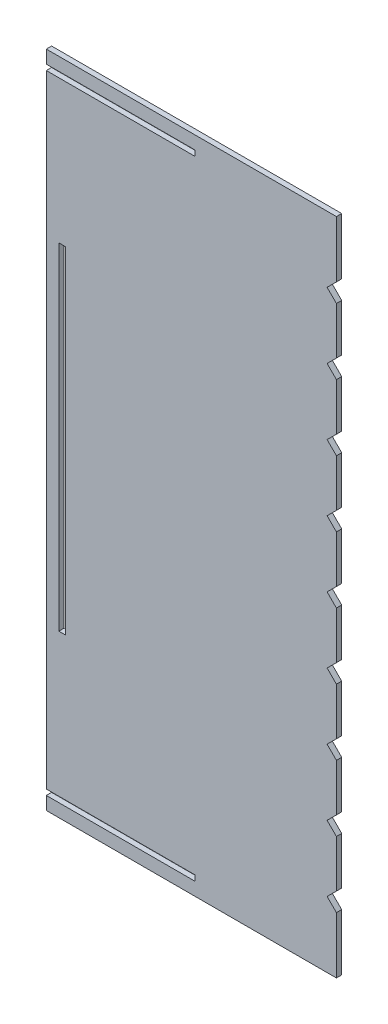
ISO-10303-21;
HEADER;
FILE_DESCRIPTION(('STEP AP214'),'2;1');
FILE_NAME('part.step','',(''),(''),'','','');
FILE_SCHEMA(('AUTOMOTIVE_DESIGN { 1 0 10303 214 1 1 1 1 }'));
ENDSEC;
DATA;
#1=APPLICATION_CONTEXT('core data for automotive mechanical design processes');
#2=APPLICATION_PROTOCOL_DEFINITION('international standard','automotive_design',2000,#1);
#3=PRODUCT_CONTEXT('',#1,'mechanical');
#4=PRODUCT('Part','Part','',(#3));
#5=PRODUCT_RELATED_PRODUCT_CATEGORY('part','',(#4));
#6=PRODUCT_DEFINITION_FORMATION('','',#4);
#7=PRODUCT_DEFINITION_CONTEXT('part definition',#1,'design');
#8=PRODUCT_DEFINITION('design','',#6,#7);
#9=PRODUCT_DEFINITION_SHAPE('','',#8);
#10=(LENGTH_UNIT() NAMED_UNIT(*) SI_UNIT(.MILLI.,.METRE.));
#11=(NAMED_UNIT(*) PLANE_ANGLE_UNIT() SI_UNIT($,.RADIAN.));
#12=(NAMED_UNIT(*) SI_UNIT($,.STERADIAN.) SOLID_ANGLE_UNIT());
#13=UNCERTAINTY_MEASURE_WITH_UNIT(LENGTH_MEASURE(1.E-05),#10,'distance_accuracy_value','');
#14=(GEOMETRIC_REPRESENTATION_CONTEXT(3) GLOBAL_UNCERTAINTY_ASSIGNED_CONTEXT((#13)) GLOBAL_UNIT_ASSIGNED_CONTEXT((#10,
#11,#12)) REPRESENTATION_CONTEXT('',''));
#15=CARTESIAN_POINT('',(0.,0.,0.));
#16=DIRECTION('',(0.,0.,1.));
#17=DIRECTION('',(1.,0.,0.));
#18=AXIS2_PLACEMENT_3D('',#15,#16,#17);
#19=CARTESIAN_POINT('',(0.,0.,4.));
#20=DIRECTION('',(0.,0.,-1.));
#21=DIRECTION('',(-1.,0.,0.));
#22=AXIS2_PLACEMENT_3D('',#19,#20,#21);
#23=PLANE('',#22);
#24=DIRECTION('',(-1.,0.,0.));
#25=VECTOR('',#24,1.);
#26=CARTESIAN_POINT('',(-1646.1818,-454.8997,4.));
#27=LINE('',#26,#25);
#28=CARTESIAN_POINT('',(-1426.1818,-454.8997,4.));
#29=VERTEX_POINT('',#28);
#30=CARTESIAN_POINT('',(-1646.1818,-454.8997,4.));
#31=VERTEX_POINT('',#30);
#32=EDGE_CURVE('E350',#29,#31,#27,.T.);
#33=ORIENTED_EDGE('',*,*,#32,.T.);
#34=DIRECTION('',(0.,-1.,0.));
#35=VECTOR('',#34,1.);
#36=CARTESIAN_POINT('',(-1646.1818,-464.7997,4.));
#37=LINE('',#36,#35);
#38=CARTESIAN_POINT('',(-1646.1818,-464.7997,4.));
#39=VERTEX_POINT('',#38);
#40=EDGE_CURVE('E353',#31,#39,#37,.T.);
#41=ORIENTED_EDGE('',*,*,#40,.T.);
#42=DIRECTION('',(1.,0.,0.));
#43=VECTOR('',#42,1.);
#44=CARTESIAN_POINT('',(-1533.3986,-464.7997,4.));
#45=LINE('',#44,#43);
#46=CARTESIAN_POINT('',(-1533.3986,-464.7997,4.));
#47=VERTEX_POINT('',#46);
#48=EDGE_CURVE('E356',#39,#47,#45,.T.);
#49=ORIENTED_EDGE('',*,*,#48,.T.);
#50=DIRECTION('',(0.,-1.,0.));
#51=VECTOR('',#50,1.);
#52=CARTESIAN_POINT('',(-1533.3986,-464.8997,4.));
#53=LINE('',#52,#51);
#54=CARTESIAN_POINT('',(-1533.3986,-468.9997,4.));
#55=VERTEX_POINT('',#54);
#56=EDGE_CURVE('E358',#47,#55,#53,.T.);
#57=ORIENTED_EDGE('',*,*,#56,.T.);
#58=DIRECTION('',(-1.,0.,0.));
#59=VECTOR('',#58,1.);
#60=CARTESIAN_POINT('',(-1646.1818,-468.9997,4.));
#61=LINE('',#60,#59);
#62=CARTESIAN_POINT('',(-1646.1818,-468.9997,4.));
#63=VERTEX_POINT('',#62);
#64=EDGE_CURVE('E360',#55,#63,#61,.T.);
#65=ORIENTED_EDGE('',*,*,#64,.T.);
#66=DIRECTION('',(0.,-1.,0.));
#67=VECTOR('',#66,1.);
#68=CARTESIAN_POINT('',(-1646.1818,-940.7996,4.));
#69=LINE('',#68,#67);
#70=CARTESIAN_POINT('',(-1646.1818,-940.7996,4.));
#71=VERTEX_POINT('',#70);
#72=EDGE_CURVE('E362',#63,#71,#69,.T.);
#73=ORIENTED_EDGE('',*,*,#72,.T.);
#74=DIRECTION('',(1.,0.,0.));
#75=VECTOR('',#74,1.);
#76=CARTESIAN_POINT('',(-1533.3986,-940.7996,4.));
#77=LINE('',#76,#75);
#78=CARTESIAN_POINT('',(-1533.3986,-940.7996,4.));
#79=VERTEX_POINT('',#78);
#80=EDGE_CURVE('E364',#71,#79,#77,.T.);
#81=ORIENTED_EDGE('',*,*,#80,.T.);
#82=DIRECTION('',(0.,-1.,0.));
#83=VECTOR('',#82,1.);
#84=CARTESIAN_POINT('',(-1533.3986,-940.8997,4.));
#85=LINE('',#84,#83);
#86=CARTESIAN_POINT('',(-1533.3986,-944.9996,4.));
#87=VERTEX_POINT('',#86);
#88=EDGE_CURVE('E366',#79,#87,#85,.T.);
#89=ORIENTED_EDGE('',*,*,#88,.T.);
#90=DIRECTION('',(-1.,0.,0.));
#91=VECTOR('',#90,1.);
#92=CARTESIAN_POINT('',(-1646.1818,-944.9996,4.));
#93=LINE('',#92,#91);
#94=CARTESIAN_POINT('',(-1646.1818,-944.9996,4.));
#95=VERTEX_POINT('',#94);
#96=EDGE_CURVE('E368',#87,#95,#93,.T.);
#97=ORIENTED_EDGE('',*,*,#96,.T.);
#98=DIRECTION('',(0.,-1.,0.));
#99=VECTOR('',#98,1.);
#100=CARTESIAN_POINT('',(-1646.1818,-954.8997,4.));
#101=LINE('',#100,#99);
#102=CARTESIAN_POINT('',(-1646.1818,-954.8997,4.));
#103=VERTEX_POINT('',#102);
#104=EDGE_CURVE('E370',#95,#103,#101,.T.);
#105=ORIENTED_EDGE('',*,*,#104,.T.);
#106=DIRECTION('',(1.,0.,0.));
#107=VECTOR('',#106,1.);
#108=CARTESIAN_POINT('',(-1426.1818,-954.8997,4.));
#109=LINE('',#108,#107);
#110=CARTESIAN_POINT('',(-1426.1818,-954.8997,4.));
#111=VERTEX_POINT('',#110);
#112=EDGE_CURVE('E372',#103,#111,#109,.T.);
#113=ORIENTED_EDGE('',*,*,#112,.T.);
#114=DIRECTION('',(0.,1.,0.));
#115=VECTOR('',#114,1.);
#116=CARTESIAN_POINT('',(-1426.1818,-911.9708,4.));
#117=LINE('',#116,#115);
#118=CARTESIAN_POINT('',(-1426.1818,-911.9708,4.));
#119=VERTEX_POINT('',#118);
#120=EDGE_CURVE('E374',#111,#119,#117,.T.);
#121=ORIENTED_EDGE('',*,*,#120,.T.);
#122=DIRECTION('',(-0.707111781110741,0.707101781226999,0.));
#123=VECTOR('',#122,1.);
#124=CARTESIAN_POINT('',(-1433.253,-904.8997,4.));
#125=LINE('',#124,#123);
#126=CARTESIAN_POINT('',(-1433.253,-904.8997,4.));
#127=VERTEX_POINT('',#126);
#128=EDGE_CURVE('E376',#119,#127,#125,.T.);
#129=ORIENTED_EDGE('',*,*,#128,.T.);
#130=DIRECTION('',(0.707116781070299,0.707096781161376,0.));
#131=VECTOR('',#130,1.);
#132=CARTESIAN_POINT('',(-1426.1818,-897.8287,4.));
#133=LINE('',#132,#131);
#134=CARTESIAN_POINT('',(-1426.1818,-897.8287,4.));
#135=VERTEX_POINT('',#134);
#136=EDGE_CURVE('E378',#127,#135,#133,.T.);
#137=ORIENTED_EDGE('',*,*,#136,.T.);
#138=DIRECTION('',(0.,1.,0.));
#139=VECTOR('',#138,1.);
#140=CARTESIAN_POINT('',(-1426.1818,-861.9708,4.));
#141=LINE('',#140,#139);
#142=CARTESIAN_POINT('',(-1426.1818,-861.9708,4.));
#143=VERTEX_POINT('',#142);
#144=EDGE_CURVE('E380',#135,#143,#141,.T.);
#145=ORIENTED_EDGE('',*,*,#144,.T.);
#146=DIRECTION('',(-0.707111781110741,0.707101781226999,0.));
#147=VECTOR('',#146,1.);
#148=CARTESIAN_POINT('',(-1433.253,-854.8997,4.));
#149=LINE('',#148,#147);
#150=CARTESIAN_POINT('',(-1433.253,-854.8997,4.));
#151=VERTEX_POINT('',#150);
#152=EDGE_CURVE('E382',#143,#151,#149,.T.);
#153=ORIENTED_EDGE('',*,*,#152,.T.);
#154=DIRECTION('',(0.707116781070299,0.707096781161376,0.));
#155=VECTOR('',#154,1.);
#156=CARTESIAN_POINT('',(-1426.1818,-847.8287,4.));
#157=LINE('',#156,#155);
#158=CARTESIAN_POINT('',(-1426.1818,-847.8287,4.));
#159=VERTEX_POINT('',#158);
#160=EDGE_CURVE('E384',#151,#159,#157,.T.);
#161=ORIENTED_EDGE('',*,*,#160,.T.);
#162=DIRECTION('',(0.,1.,0.));
#163=VECTOR('',#162,1.);
#164=CARTESIAN_POINT('',(-1426.1818,-811.9708,4.));
#165=LINE('',#164,#163);
#166=CARTESIAN_POINT('',(-1426.1818,-811.9708,4.));
#167=VERTEX_POINT('',#166);
#168=EDGE_CURVE('E386',#159,#167,#165,.T.);
#169=ORIENTED_EDGE('',*,*,#168,.T.);
#170=DIRECTION('',(-0.707111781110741,0.707101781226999,0.));
#171=VECTOR('',#170,1.);
#172=CARTESIAN_POINT('',(-1433.253,-804.8997,4.));
#173=LINE('',#172,#171);
#174=CARTESIAN_POINT('',(-1433.253,-804.8997,4.));
#175=VERTEX_POINT('',#174);
#176=EDGE_CURVE('E388',#167,#175,#173,.T.);
#177=ORIENTED_EDGE('',*,*,#176,.T.);
#178=DIRECTION('',(0.707111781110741,0.707101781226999,0.));
#179=VECTOR('',#178,1.);
#180=CARTESIAN_POINT('',(-1426.1818,-797.8286,4.));
#181=LINE('',#180,#179);
#182=CARTESIAN_POINT('',(-1426.1818,-797.8286,4.));
#183=VERTEX_POINT('',#182);
#184=EDGE_CURVE('E390',#175,#183,#181,.T.);
#185=ORIENTED_EDGE('',*,*,#184,.T.);
#186=DIRECTION('',(0.,1.,0.));
#187=VECTOR('',#186,1.);
#188=CARTESIAN_POINT('',(-1426.1818,-761.9708,4.));
#189=LINE('',#188,#187);
#190=CARTESIAN_POINT('',(-1426.1818,-761.9708,4.));
#191=VERTEX_POINT('',#190);
#192=EDGE_CURVE('E392',#183,#191,#189,.T.);
#193=ORIENTED_EDGE('',*,*,#192,.T.);
#194=DIRECTION('',(-0.707111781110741,0.707101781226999,0.));
#195=VECTOR('',#194,1.);
#196=CARTESIAN_POINT('',(-1433.253,-754.8997,4.));
#197=LINE('',#196,#195);
#198=CARTESIAN_POINT('',(-1433.253,-754.8997,4.));
#199=VERTEX_POINT('',#198);
#200=EDGE_CURVE('E394',#191,#199,#197,.T.);
#201=ORIENTED_EDGE('',*,*,#200,.T.);
#202=DIRECTION('',(0.707111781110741,0.707101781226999,0.));
#203=VECTOR('',#202,1.);
#204=CARTESIAN_POINT('',(-1426.1818,-747.8286,4.));
#205=LINE('',#204,#203);
#206=CARTESIAN_POINT('',(-1426.1818,-747.8286,4.));
#207=VERTEX_POINT('',#206);
#208=EDGE_CURVE('E396',#199,#207,#205,.T.);
#209=ORIENTED_EDGE('',*,*,#208,.T.);
#210=DIRECTION('',(0.,1.,0.));
#211=VECTOR('',#210,1.);
#212=CARTESIAN_POINT('',(-1426.1818,-711.9708,4.));
#213=LINE('',#212,#211);
#214=CARTESIAN_POINT('',(-1426.1818,-711.9708,4.));
#215=VERTEX_POINT('',#214);
#216=EDGE_CURVE('E398',#207,#215,#213,.T.);
#217=ORIENTED_EDGE('',*,*,#216,.T.);
#218=DIRECTION('',(-0.707111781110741,0.707101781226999,0.));
#219=VECTOR('',#218,1.);
#220=CARTESIAN_POINT('',(-1433.253,-704.8997,4.));
#221=LINE('',#220,#219);
#222=CARTESIAN_POINT('',(-1433.253,-704.8997,4.));
#223=VERTEX_POINT('',#222);
#224=EDGE_CURVE('E400',#215,#223,#221,.T.);
#225=ORIENTED_EDGE('',*,*,#224,.T.);
#226=DIRECTION('',(0.707111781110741,0.707101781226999,0.));
#227=VECTOR('',#226,1.);
#228=CARTESIAN_POINT('',(-1426.1818,-697.8286,4.));
#229=LINE('',#228,#227);
#230=CARTESIAN_POINT('',(-1426.1818,-697.8286,4.));
#231=VERTEX_POINT('',#230);
#232=EDGE_CURVE('E402',#223,#231,#229,.T.);
#233=ORIENTED_EDGE('',*,*,#232,.T.);
#234=DIRECTION('',(0.,1.,0.));
#235=VECTOR('',#234,1.);
#236=CARTESIAN_POINT('',(-1426.1818,-661.9708,4.));
#237=LINE('',#236,#235);
#238=CARTESIAN_POINT('',(-1426.1818,-661.9708,4.));
#239=VERTEX_POINT('',#238);
#240=EDGE_CURVE('E404',#231,#239,#237,.T.);
#241=ORIENTED_EDGE('',*,*,#240,.T.);
#242=DIRECTION('',(-0.707111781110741,0.707101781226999,0.));
#243=VECTOR('',#242,1.);
#244=CARTESIAN_POINT('',(-1433.253,-654.8997,4.));
#245=LINE('',#244,#243);
#246=CARTESIAN_POINT('',(-1433.253,-654.8997,4.));
#247=VERTEX_POINT('',#246);
#248=EDGE_CURVE('E406',#239,#247,#245,.T.);
#249=ORIENTED_EDGE('',*,*,#248,.T.);
#250=DIRECTION('',(0.707111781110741,0.707101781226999,0.));
#251=VECTOR('',#250,1.);
#252=CARTESIAN_POINT('',(-1426.1818,-647.8286,4.));
#253=LINE('',#252,#251);
#254=CARTESIAN_POINT('',(-1426.1818,-647.8286,4.));
#255=VERTEX_POINT('',#254);
#256=EDGE_CURVE('E408',#247,#255,#253,.T.);
#257=ORIENTED_EDGE('',*,*,#256,.T.);
#258=DIRECTION('',(0.,1.,0.));
#259=VECTOR('',#258,1.);
#260=CARTESIAN_POINT('',(-1426.1818,-611.9708,4.));
#261=LINE('',#260,#259);
#262=CARTESIAN_POINT('',(-1426.1818,-611.9708,4.));
#263=VERTEX_POINT('',#262);
#264=EDGE_CURVE('E410',#255,#263,#261,.T.);
#265=ORIENTED_EDGE('',*,*,#264,.T.);
#266=DIRECTION('',(-0.707111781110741,0.707101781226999,0.));
#267=VECTOR('',#266,1.);
#268=CARTESIAN_POINT('',(-1433.253,-604.8997,4.));
#269=LINE('',#268,#267);
#270=CARTESIAN_POINT('',(-1433.253,-604.8997,4.));
#271=VERTEX_POINT('',#270);
#272=EDGE_CURVE('E412',#263,#271,#269,.T.);
#273=ORIENTED_EDGE('',*,*,#272,.T.);
#274=DIRECTION('',(0.707111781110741,0.707101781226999,0.));
#275=VECTOR('',#274,1.);
#276=CARTESIAN_POINT('',(-1426.1818,-597.8286,4.));
#277=LINE('',#276,#275);
#278=CARTESIAN_POINT('',(-1426.1818,-597.8286,4.));
#279=VERTEX_POINT('',#278);
#280=EDGE_CURVE('E414',#271,#279,#277,.T.);
#281=ORIENTED_EDGE('',*,*,#280,.T.);
#282=DIRECTION('',(0.,1.,0.));
#283=VECTOR('',#282,1.);
#284=CARTESIAN_POINT('',(-1426.1818,-561.9708,4.));
#285=LINE('',#284,#283);
#286=CARTESIAN_POINT('',(-1426.1818,-561.9708,4.));
#287=VERTEX_POINT('',#286);
#288=EDGE_CURVE('E416',#279,#287,#285,.T.);
#289=ORIENTED_EDGE('',*,*,#288,.T.);
#290=DIRECTION('',(-0.707111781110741,0.707101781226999,0.));
#291=VECTOR('',#290,1.);
#292=CARTESIAN_POINT('',(-1433.253,-554.8997,4.));
#293=LINE('',#292,#291);
#294=CARTESIAN_POINT('',(-1433.253,-554.8997,4.));
#295=VERTEX_POINT('',#294);
#296=EDGE_CURVE('E418',#287,#295,#293,.T.);
#297=ORIENTED_EDGE('',*,*,#296,.T.);
#298=DIRECTION('',(0.707116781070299,0.707096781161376,0.));
#299=VECTOR('',#298,1.);
#300=CARTESIAN_POINT('',(-1426.1818,-547.8287,4.));
#301=LINE('',#300,#299);
#302=CARTESIAN_POINT('',(-1426.1818,-547.8287,4.));
#303=VERTEX_POINT('',#302);
#304=EDGE_CURVE('E420',#295,#303,#301,.T.);
#305=ORIENTED_EDGE('',*,*,#304,.T.);
#306=DIRECTION('',(0.,1.,0.));
#307=VECTOR('',#306,1.);
#308=CARTESIAN_POINT('',(-1426.1818,-511.9708,4.));
#309=LINE('',#308,#307);
#310=CARTESIAN_POINT('',(-1426.1818,-511.9708,4.));
#311=VERTEX_POINT('',#310);
#312=EDGE_CURVE('E422',#303,#311,#309,.T.);
#313=ORIENTED_EDGE('',*,*,#312,.T.);
#314=DIRECTION('',(-0.707111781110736,0.707101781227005,0.));
#315=VECTOR('',#314,1.);
#316=CARTESIAN_POINT('',(-1433.253,-504.8997,4.));
#317=LINE('',#316,#315);
#318=CARTESIAN_POINT('',(-1433.253,-504.8997,4.));
#319=VERTEX_POINT('',#318);
#320=EDGE_CURVE('E424',#311,#319,#317,.T.);
#321=ORIENTED_EDGE('',*,*,#320,.T.);
#322=DIRECTION('',(0.707116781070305,0.70709678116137,0.));
#323=VECTOR('',#322,1.);
#324=CARTESIAN_POINT('',(-1426.1818,-497.8287,4.));
#325=LINE('',#324,#323);
#326=CARTESIAN_POINT('',(-1426.1818,-497.8287,4.));
#327=VERTEX_POINT('',#326);
#328=EDGE_CURVE('E426',#319,#327,#325,.T.);
#329=ORIENTED_EDGE('',*,*,#328,.T.);
#330=DIRECTION('',(0.,1.,0.));
#331=VECTOR('',#330,1.);
#332=CARTESIAN_POINT('',(-1426.1818,-454.8997,4.));
#333=LINE('',#332,#331);
#334=EDGE_CURVE('E428',#327,#29,#333,.T.);
#335=ORIENTED_EDGE('',*,*,#334,.T.);
#336=EDGE_LOOP('',(#33,#41,#49,#57,#65,#73,#81,#89,#97,#105,#113,#121,#129,#137,#145,#153,#161,
#169,#177,#185,#193,#201,#209,#217,#225,#233,#241,#249,#257,#265,#273,#281,#289,#297,#305,#313,
#321,#329,#335));
#337=FACE_BOUND('',#336,.T.);
#338=DIRECTION('',(1.,0.,0.));
#339=VECTOR('',#338,1.);
#340=CARTESIAN_POINT('',(-1636.6818,-832.3997,4.));
#341=LINE('',#340,#339);
#342=CARTESIAN_POINT('',(-1636.6818,-832.3997,4.));
#343=VERTEX_POINT('',#342);
#344=CARTESIAN_POINT('',(-1631.6818,-832.3997,4.));
#345=VERTEX_POINT('',#344);
#346=EDGE_CURVE('E314',#343,#345,#341,.T.);
#347=ORIENTED_EDGE('',*,*,#346,.F.);
#348=DIRECTION('',(0.,-1.,0.));
#349=VECTOR('',#348,1.);
#350=CARTESIAN_POINT('',(-1636.6818,-577.3997,4.));
#351=LINE('',#350,#349);
#352=CARTESIAN_POINT('',(-1636.6818,-577.3997,4.));
#353=VERTEX_POINT('',#352);
#354=EDGE_CURVE('E336',#353,#343,#351,.T.);
#355=ORIENTED_EDGE('',*,*,#354,.F.);
#356=DIRECTION('',(-1.,0.,0.));
#357=VECTOR('',#356,1.);
#358=CARTESIAN_POINT('',(-1631.6818,-577.3997,4.));
#359=LINE('',#358,#357);
#360=CARTESIAN_POINT('',(-1631.6818,-577.3997,4.));
#361=VERTEX_POINT('',#360);
#362=EDGE_CURVE('E334',#361,#353,#359,.T.);
#363=ORIENTED_EDGE('',*,*,#362,.F.);
#364=DIRECTION('',(0.,1.,0.));
#365=VECTOR('',#364,1.);
#366=CARTESIAN_POINT('',(-1631.6818,-832.3997,4.));
#367=LINE('',#366,#365);
#368=EDGE_CURVE('E322',#345,#361,#367,.T.);
#369=ORIENTED_EDGE('',*,*,#368,.F.);
#370=EDGE_LOOP('',(#347,#355,#363,#369));
#371=FACE_BOUND('',#370,.T.);
#372=ADVANCED_FACE('F39',(#337,#371),#23,.F.);
#373=CARTESIAN_POINT('',(0.,0.,0.));
#374=DIRECTION('',(0.,0.,-1.));
#375=DIRECTION('',(-1.,0.,0.));
#376=AXIS2_PLACEMENT_3D('',#373,#374,#375);
#377=PLANE('',#376);
#378=DIRECTION('',(-1.,0.,0.));
#379=VECTOR('',#378,1.);
#380=CARTESIAN_POINT('',(-1646.1818,-454.8997,0.));
#381=LINE('',#380,#379);
#382=CARTESIAN_POINT('',(-1426.1818,-454.8997,0.));
#383=VERTEX_POINT('',#382);
#384=CARTESIAN_POINT('',(-1646.1818,-454.8997,0.));
#385=VERTEX_POINT('',#384);
#386=EDGE_CURVE('E330',#383,#385,#381,.T.);
#387=ORIENTED_EDGE('',*,*,#386,.F.);
#388=DIRECTION('',(0.,1.,0.));
#389=VECTOR('',#388,1.);
#390=CARTESIAN_POINT('',(-1426.1818,-454.8997,0.));
#391=LINE('',#390,#389);
#392=CARTESIAN_POINT('',(-1426.1818,-497.8287,0.));
#393=VERTEX_POINT('',#392);
#394=EDGE_CURVE('E354',#393,#383,#391,.T.);
#395=ORIENTED_EDGE('',*,*,#394,.F.);
#396=DIRECTION('',(0.707116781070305,0.70709678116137,0.));
#397=VECTOR('',#396,1.);
#398=CARTESIAN_POINT('',(-1426.1818,-497.8287,0.));
#399=LINE('',#398,#397);
#400=CARTESIAN_POINT('',(-1433.253,-504.8997,0.));
#401=VERTEX_POINT('',#400);
#402=EDGE_CURVE('E507',#401,#393,#399,.T.);
#403=ORIENTED_EDGE('',*,*,#402,.F.);
#404=DIRECTION('',(-0.707111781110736,0.707101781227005,0.));
#405=VECTOR('',#404,1.);
#406=CARTESIAN_POINT('',(-1433.253,-504.8997,0.));
#407=LINE('',#406,#405);
#408=CARTESIAN_POINT('',(-1426.1818,-511.9708,0.));
#409=VERTEX_POINT('',#408);
#410=EDGE_CURVE('E505',#409,#401,#407,.T.);
#411=ORIENTED_EDGE('',*,*,#410,.F.);
#412=DIRECTION('',(0.,1.,0.));
#413=VECTOR('',#412,1.);
#414=CARTESIAN_POINT('',(-1426.1818,-511.9708,0.));
#415=LINE('',#414,#413);
#416=CARTESIAN_POINT('',(-1426.1818,-547.8287,0.));
#417=VERTEX_POINT('',#416);
#418=EDGE_CURVE('E503',#417,#409,#415,.T.);
#419=ORIENTED_EDGE('',*,*,#418,.F.);
#420=DIRECTION('',(0.707116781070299,0.707096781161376,0.));
#421=VECTOR('',#420,1.);
#422=CARTESIAN_POINT('',(-1426.1818,-547.8287,0.));
#423=LINE('',#422,#421);
#424=CARTESIAN_POINT('',(-1433.253,-554.8997,0.));
#425=VERTEX_POINT('',#424);
#426=EDGE_CURVE('E501',#425,#417,#423,.T.);
#427=ORIENTED_EDGE('',*,*,#426,.F.);
#428=DIRECTION('',(-0.707111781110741,0.707101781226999,0.));
#429=VECTOR('',#428,1.);
#430=CARTESIAN_POINT('',(-1433.253,-554.8997,0.));
#431=LINE('',#430,#429);
#432=CARTESIAN_POINT('',(-1426.1818,-561.9708,0.));
#433=VERTEX_POINT('',#432);
#434=EDGE_CURVE('E499',#433,#425,#431,.T.);
#435=ORIENTED_EDGE('',*,*,#434,.F.);
#436=DIRECTION('',(0.,1.,0.));
#437=VECTOR('',#436,1.);
#438=CARTESIAN_POINT('',(-1426.1818,-561.9708,0.));
#439=LINE('',#438,#437);
#440=CARTESIAN_POINT('',(-1426.1818,-597.8286,0.));
#441=VERTEX_POINT('',#440);
#442=EDGE_CURVE('E497',#441,#433,#439,.T.);
#443=ORIENTED_EDGE('',*,*,#442,.F.);
#444=DIRECTION('',(0.707111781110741,0.707101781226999,0.));
#445=VECTOR('',#444,1.);
#446=CARTESIAN_POINT('',(-1426.1818,-597.8286,0.));
#447=LINE('',#446,#445);
#448=CARTESIAN_POINT('',(-1433.253,-604.8997,0.));
#449=VERTEX_POINT('',#448);
#450=EDGE_CURVE('E495',#449,#441,#447,.T.);
#451=ORIENTED_EDGE('',*,*,#450,.F.);
#452=DIRECTION('',(-0.707111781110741,0.707101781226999,0.));
#453=VECTOR('',#452,1.);
#454=CARTESIAN_POINT('',(-1433.253,-604.8997,0.));
#455=LINE('',#454,#453);
#456=CARTESIAN_POINT('',(-1426.1818,-611.9708,0.));
#457=VERTEX_POINT('',#456);
#458=EDGE_CURVE('E493',#457,#449,#455,.T.);
#459=ORIENTED_EDGE('',*,*,#458,.F.);
#460=DIRECTION('',(0.,1.,0.));
#461=VECTOR('',#460,1.);
#462=CARTESIAN_POINT('',(-1426.1818,-611.9708,0.));
#463=LINE('',#462,#461);
#464=CARTESIAN_POINT('',(-1426.1818,-647.8286,0.));
#465=VERTEX_POINT('',#464);
#466=EDGE_CURVE('E491',#465,#457,#463,.T.);
#467=ORIENTED_EDGE('',*,*,#466,.F.);
#468=DIRECTION('',(0.707111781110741,0.707101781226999,0.));
#469=VECTOR('',#468,1.);
#470=CARTESIAN_POINT('',(-1426.1818,-647.8286,0.));
#471=LINE('',#470,#469);
#472=CARTESIAN_POINT('',(-1433.253,-654.8997,0.));
#473=VERTEX_POINT('',#472);
#474=EDGE_CURVE('E489',#473,#465,#471,.T.);
#475=ORIENTED_EDGE('',*,*,#474,.F.);
#476=DIRECTION('',(-0.707111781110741,0.707101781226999,0.));
#477=VECTOR('',#476,1.);
#478=CARTESIAN_POINT('',(-1433.253,-654.8997,0.));
#479=LINE('',#478,#477);
#480=CARTESIAN_POINT('',(-1426.1818,-661.9708,0.));
#481=VERTEX_POINT('',#480);
#482=EDGE_CURVE('E487',#481,#473,#479,.T.);
#483=ORIENTED_EDGE('',*,*,#482,.F.);
#484=DIRECTION('',(0.,1.,0.));
#485=VECTOR('',#484,1.);
#486=CARTESIAN_POINT('',(-1426.1818,-661.9708,0.));
#487=LINE('',#486,#485);
#488=CARTESIAN_POINT('',(-1426.1818,-697.8286,0.));
#489=VERTEX_POINT('',#488);
#490=EDGE_CURVE('E485',#489,#481,#487,.T.);
#491=ORIENTED_EDGE('',*,*,#490,.F.);
#492=DIRECTION('',(0.707111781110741,0.707101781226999,0.));
#493=VECTOR('',#492,1.);
#494=CARTESIAN_POINT('',(-1426.1818,-697.8286,0.));
#495=LINE('',#494,#493);
#496=CARTESIAN_POINT('',(-1433.253,-704.8997,0.));
#497=VERTEX_POINT('',#496);
#498=EDGE_CURVE('E483',#497,#489,#495,.T.);
#499=ORIENTED_EDGE('',*,*,#498,.F.);
#500=DIRECTION('',(-0.707111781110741,0.707101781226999,0.));
#501=VECTOR('',#500,1.);
#502=CARTESIAN_POINT('',(-1433.253,-704.8997,0.));
#503=LINE('',#502,#501);
#504=CARTESIAN_POINT('',(-1426.1818,-711.9708,0.));
#505=VERTEX_POINT('',#504);
#506=EDGE_CURVE('E481',#505,#497,#503,.T.);
#507=ORIENTED_EDGE('',*,*,#506,.F.);
#508=DIRECTION('',(0.,1.,0.));
#509=VECTOR('',#508,1.);
#510=CARTESIAN_POINT('',(-1426.1818,-711.9708,0.));
#511=LINE('',#510,#509);
#512=CARTESIAN_POINT('',(-1426.1818,-747.8286,0.));
#513=VERTEX_POINT('',#512);
#514=EDGE_CURVE('E479',#513,#505,#511,.T.);
#515=ORIENTED_EDGE('',*,*,#514,.F.);
#516=DIRECTION('',(0.707111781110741,0.707101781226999,0.));
#517=VECTOR('',#516,1.);
#518=CARTESIAN_POINT('',(-1426.1818,-747.8286,0.));
#519=LINE('',#518,#517);
#520=CARTESIAN_POINT('',(-1433.253,-754.8997,0.));
#521=VERTEX_POINT('',#520);
#522=EDGE_CURVE('E477',#521,#513,#519,.T.);
#523=ORIENTED_EDGE('',*,*,#522,.F.);
#524=DIRECTION('',(-0.707111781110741,0.707101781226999,0.));
#525=VECTOR('',#524,1.);
#526=CARTESIAN_POINT('',(-1433.253,-754.8997,0.));
#527=LINE('',#526,#525);
#528=CARTESIAN_POINT('',(-1426.1818,-761.9708,0.));
#529=VERTEX_POINT('',#528);
#530=EDGE_CURVE('E475',#529,#521,#527,.T.);
#531=ORIENTED_EDGE('',*,*,#530,.F.);
#532=DIRECTION('',(0.,1.,0.));
#533=VECTOR('',#532,1.);
#534=CARTESIAN_POINT('',(-1426.1818,-761.9708,0.));
#535=LINE('',#534,#533);
#536=CARTESIAN_POINT('',(-1426.1818,-797.8286,0.));
#537=VERTEX_POINT('',#536);
#538=EDGE_CURVE('E473',#537,#529,#535,.T.);
#539=ORIENTED_EDGE('',*,*,#538,.F.);
#540=DIRECTION('',(0.707111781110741,0.707101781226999,0.));
#541=VECTOR('',#540,1.);
#542=CARTESIAN_POINT('',(-1426.1818,-797.8286,0.));
#543=LINE('',#542,#541);
#544=CARTESIAN_POINT('',(-1433.253,-804.8997,0.));
#545=VERTEX_POINT('',#544);
#546=EDGE_CURVE('E471',#545,#537,#543,.T.);
#547=ORIENTED_EDGE('',*,*,#546,.F.);
#548=DIRECTION('',(-0.707111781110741,0.707101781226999,0.));
#549=VECTOR('',#548,1.);
#550=CARTESIAN_POINT('',(-1433.253,-804.8997,0.));
#551=LINE('',#550,#549);
#552=CARTESIAN_POINT('',(-1426.1818,-811.9708,0.));
#553=VERTEX_POINT('',#552);
#554=EDGE_CURVE('E469',#553,#545,#551,.T.);
#555=ORIENTED_EDGE('',*,*,#554,.F.);
#556=DIRECTION('',(0.,1.,0.));
#557=VECTOR('',#556,1.);
#558=CARTESIAN_POINT('',(-1426.1818,-811.9708,0.));
#559=LINE('',#558,#557);
#560=CARTESIAN_POINT('',(-1426.1818,-847.8287,0.));
#561=VERTEX_POINT('',#560);
#562=EDGE_CURVE('E467',#561,#553,#559,.T.);
#563=ORIENTED_EDGE('',*,*,#562,.F.);
#564=DIRECTION('',(0.707116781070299,0.707096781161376,0.));
#565=VECTOR('',#564,1.);
#566=CARTESIAN_POINT('',(-1426.1818,-847.8287,0.));
#567=LINE('',#566,#565);
#568=CARTESIAN_POINT('',(-1433.253,-854.8997,0.));
#569=VERTEX_POINT('',#568);
#570=EDGE_CURVE('E465',#569,#561,#567,.T.);
#571=ORIENTED_EDGE('',*,*,#570,.F.);
#572=DIRECTION('',(-0.707111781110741,0.707101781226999,0.));
#573=VECTOR('',#572,1.);
#574=CARTESIAN_POINT('',(-1433.253,-854.8997,0.));
#575=LINE('',#574,#573);
#576=CARTESIAN_POINT('',(-1426.1818,-861.9708,0.));
#577=VERTEX_POINT('',#576);
#578=EDGE_CURVE('E463',#577,#569,#575,.T.);
#579=ORIENTED_EDGE('',*,*,#578,.F.);
#580=DIRECTION('',(0.,1.,0.));
#581=VECTOR('',#580,1.);
#582=CARTESIAN_POINT('',(-1426.1818,-861.9708,0.));
#583=LINE('',#582,#581);
#584=CARTESIAN_POINT('',(-1426.1818,-897.8287,0.));
#585=VERTEX_POINT('',#584);
#586=EDGE_CURVE('E461',#585,#577,#583,.T.);
#587=ORIENTED_EDGE('',*,*,#586,.F.);
#588=DIRECTION('',(0.707116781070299,0.707096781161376,0.));
#589=VECTOR('',#588,1.);
#590=CARTESIAN_POINT('',(-1426.1818,-897.8287,0.));
#591=LINE('',#590,#589);
#592=CARTESIAN_POINT('',(-1433.253,-904.8997,0.));
#593=VERTEX_POINT('',#592);
#594=EDGE_CURVE('E459',#593,#585,#591,.T.);
#595=ORIENTED_EDGE('',*,*,#594,.F.);
#596=DIRECTION('',(-0.707111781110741,0.707101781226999,0.));
#597=VECTOR('',#596,1.);
#598=CARTESIAN_POINT('',(-1433.253,-904.8997,0.));
#599=LINE('',#598,#597);
#600=CARTESIAN_POINT('',(-1426.1818,-911.9708,0.));
#601=VERTEX_POINT('',#600);
#602=EDGE_CURVE('E457',#601,#593,#599,.T.);
#603=ORIENTED_EDGE('',*,*,#602,.F.);
#604=DIRECTION('',(0.,1.,0.));
#605=VECTOR('',#604,1.);
#606=CARTESIAN_POINT('',(-1426.1818,-911.9708,0.));
#607=LINE('',#606,#605);
#608=CARTESIAN_POINT('',(-1426.1818,-954.8997,0.));
#609=VERTEX_POINT('',#608);
#610=EDGE_CURVE('E455',#609,#601,#607,.T.);
#611=ORIENTED_EDGE('',*,*,#610,.F.);
#612=DIRECTION('',(1.,0.,0.));
#613=VECTOR('',#612,1.);
#614=CARTESIAN_POINT('',(-1426.1818,-954.8997,0.));
#615=LINE('',#614,#613);
#616=CARTESIAN_POINT('',(-1646.1818,-954.8997,0.));
#617=VERTEX_POINT('',#616);
#618=EDGE_CURVE('E453',#617,#609,#615,.T.);
#619=ORIENTED_EDGE('',*,*,#618,.F.);
#620=DIRECTION('',(0.,-1.,0.));
#621=VECTOR('',#620,1.);
#622=CARTESIAN_POINT('',(-1646.1818,-954.8997,0.));
#623=LINE('',#622,#621);
#624=CARTESIAN_POINT('',(-1646.1818,-944.9996,0.));
#625=VERTEX_POINT('',#624);
#626=EDGE_CURVE('E451',#625,#617,#623,.T.);
#627=ORIENTED_EDGE('',*,*,#626,.F.);
#628=DIRECTION('',(-1.,0.,0.));
#629=VECTOR('',#628,1.);
#630=CARTESIAN_POINT('',(-1646.1818,-944.9996,0.));
#631=LINE('',#630,#629);
#632=CARTESIAN_POINT('',(-1533.3986,-944.9996,0.));
#633=VERTEX_POINT('',#632);
#634=EDGE_CURVE('E449',#633,#625,#631,.T.);
#635=ORIENTED_EDGE('',*,*,#634,.F.);
#636=DIRECTION('',(0.,-1.,0.));
#637=VECTOR('',#636,1.);
#638=CARTESIAN_POINT('',(-1533.3986,-944.9996,0.));
#639=LINE('',#638,#637);
#640=CARTESIAN_POINT('',(-1533.3986,-940.7996,0.));
#641=VERTEX_POINT('',#640);
#642=EDGE_CURVE('E447',#641,#633,#639,.T.);
#643=ORIENTED_EDGE('',*,*,#642,.F.);
#644=DIRECTION('',(1.,0.,0.));
#645=VECTOR('',#644,1.);
#646=CARTESIAN_POINT('',(-1533.3986,-940.7996,0.));
#647=LINE('',#646,#645);
#648=CARTESIAN_POINT('',(-1646.1818,-940.7996,0.));
#649=VERTEX_POINT('',#648);
#650=EDGE_CURVE('E444',#649,#641,#647,.T.);
#651=ORIENTED_EDGE('',*,*,#650,.F.);
#652=DIRECTION('',(0.,-1.,0.));
#653=VECTOR('',#652,1.);
#654=CARTESIAN_POINT('',(-1646.1818,-940.7996,0.));
#655=LINE('',#654,#653);
#656=CARTESIAN_POINT('',(-1646.1818,-468.9997,0.));
#657=VERTEX_POINT('',#656);
#658=EDGE_CURVE('E442',#657,#649,#655,.T.);
#659=ORIENTED_EDGE('',*,*,#658,.F.);
#660=DIRECTION('',(-1.,0.,0.));
#661=VECTOR('',#660,1.);
#662=CARTESIAN_POINT('',(-1646.1818,-468.9997,0.));
#663=LINE('',#662,#661);
#664=CARTESIAN_POINT('',(-1533.3986,-468.9997,0.));
#665=VERTEX_POINT('',#664);
#666=EDGE_CURVE('E440',#665,#657,#663,.T.);
#667=ORIENTED_EDGE('',*,*,#666,.F.);
#668=DIRECTION('',(0.,-1.,0.));
#669=VECTOR('',#668,1.);
#670=CARTESIAN_POINT('',(-1533.3986,-468.9997,0.));
#671=LINE('',#670,#669);
#672=CARTESIAN_POINT('',(-1533.3986,-464.7997,0.));
#673=VERTEX_POINT('',#672);
#674=EDGE_CURVE('E438',#673,#665,#671,.T.);
#675=ORIENTED_EDGE('',*,*,#674,.F.);
#676=DIRECTION('',(1.,0.,0.));
#677=VECTOR('',#676,1.);
#678=CARTESIAN_POINT('',(-1533.3986,-464.7997,0.));
#679=LINE('',#678,#677);
#680=CARTESIAN_POINT('',(-1646.1818,-464.7997,0.));
#681=VERTEX_POINT('',#680);
#682=EDGE_CURVE('E435',#681,#673,#679,.T.);
#683=ORIENTED_EDGE('',*,*,#682,.F.);
#684=DIRECTION('',(0.,-1.,0.));
#685=VECTOR('',#684,1.);
#686=CARTESIAN_POINT('',(-1646.1818,-464.7997,0.));
#687=LINE('',#686,#685);
#688=EDGE_CURVE('E433',#385,#681,#687,.T.);
#689=ORIENTED_EDGE('',*,*,#688,.F.);
#690=EDGE_LOOP('',(#387,#395,#403,#411,#419,#427,#435,#443,#451,#459,#467,#475,#483,#491,#499,
#507,#515,#523,#531,#539,#547,#555,#563,#571,#579,#587,#595,#603,#611,#619,#627,#635,#643,#651,
#659,#667,#675,#683,#689));
#691=FACE_BOUND('',#690,.T.);
#692=DIRECTION('',(0.,-1.,0.));
#693=VECTOR('',#692,1.);
#694=CARTESIAN_POINT('',(-1636.6818,-577.3997,0.));
#695=LINE('',#694,#693);
#696=CARTESIAN_POINT('',(-1636.6818,-577.3997,0.));
#697=VERTEX_POINT('',#696);
#698=CARTESIAN_POINT('',(-1636.6818,-832.3997,0.));
#699=VERTEX_POINT('',#698);
#700=EDGE_CURVE('E323',#697,#699,#695,.T.);
#701=ORIENTED_EDGE('',*,*,#700,.T.);
#702=DIRECTION('',(1.,0.,0.));
#703=VECTOR('',#702,1.);
#704=CARTESIAN_POINT('',(-1636.6818,-832.3997,0.));
#705=LINE('',#704,#703);
#706=CARTESIAN_POINT('',(-1631.6818,-832.3997,0.));
#707=VERTEX_POINT('',#706);
#708=EDGE_CURVE('E62',#699,#707,#705,.T.);
#709=ORIENTED_EDGE('',*,*,#708,.T.);
#710=DIRECTION('',(0.,1.,0.));
#711=VECTOR('',#710,1.);
#712=CARTESIAN_POINT('',(-1631.6818,-832.3997,0.));
#713=LINE('',#712,#711);
#714=CARTESIAN_POINT('',(-1631.6818,-577.3997,0.));
#715=VERTEX_POINT('',#714);
#716=EDGE_CURVE('E329',#707,#715,#713,.T.);
#717=ORIENTED_EDGE('',*,*,#716,.T.);
#718=DIRECTION('',(-1.,0.,0.));
#719=VECTOR('',#718,1.);
#720=CARTESIAN_POINT('',(-1631.6818,-577.3997,0.));
#721=LINE('',#720,#719);
#722=EDGE_CURVE('E342',#715,#697,#721,.T.);
#723=ORIENTED_EDGE('',*,*,#722,.T.);
#724=EDGE_LOOP('',(#701,#709,#717,#723));
#725=FACE_BOUND('',#724,.T.);
#726=ADVANCED_FACE('F629',(#691,#725),#377,.T.);
#727=CARTESIAN_POINT('',(-1646.1818,-454.8997,4.));
#728=DIRECTION('',(0.,-1.,0.));
#729=DIRECTION('',(0.,0.,-1.));
#730=AXIS2_PLACEMENT_3D('',#727,#728,#729);
#731=PLANE('',#730);
#732=ORIENTED_EDGE('',*,*,#386,.T.);
#733=DIRECTION('',(0.,0.,-1.));
#734=VECTOR('',#733,1.);
#735=CARTESIAN_POINT('',(-1646.1818,-454.8997,4.));
#736=LINE('',#735,#734);
#737=EDGE_CURVE('E11',#31,#385,#736,.T.);
#738=ORIENTED_EDGE('',*,*,#737,.F.);
#739=ORIENTED_EDGE('',*,*,#32,.F.);
#740=DIRECTION('',(0.,0.,-1.));
#741=VECTOR('',#740,1.);
#742=CARTESIAN_POINT('',(-1426.1818,-454.8997,4.));
#743=LINE('',#742,#741);
#744=EDGE_CURVE('E430',#29,#383,#743,.T.);
#745=ORIENTED_EDGE('',*,*,#744,.T.);
#746=EDGE_LOOP('',(#732,#738,#739,#745));
#747=FACE_BOUND('',#746,.T.);
#748=ADVANCED_FACE('F41',(#747),#731,.F.);
#749=CARTESIAN_POINT('',(-1646.1818,-464.7997,4.));
#750=DIRECTION('',(1.,0.,0.));
#751=DIRECTION('',(0.,0.,-1.));
#752=AXIS2_PLACEMENT_3D('',#749,#750,#751);
#753=PLANE('',#752);
#754=ORIENTED_EDGE('',*,*,#688,.T.);
#755=DIRECTION('',(0.,0.,-1.));
#756=VECTOR('',#755,1.);
#757=CARTESIAN_POINT('',(-1646.1818,-464.7997,4.));
#758=LINE('',#757,#756);
#759=EDGE_CURVE('E47',#39,#681,#758,.T.);
#760=ORIENTED_EDGE('',*,*,#759,.F.);
#761=ORIENTED_EDGE('',*,*,#40,.F.);
#762=ORIENTED_EDGE('',*,*,#737,.T.);
#763=EDGE_LOOP('',(#754,#760,#761,#762));
#764=FACE_BOUND('',#763,.T.);
#765=ADVANCED_FACE('F646',(#764),#753,.F.);
#766=CARTESIAN_POINT('',(-1533.3986,-464.7997,4.));
#767=DIRECTION('',(0.,1.,0.));
#768=DIRECTION('',(0.,0.,1.));
#769=AXIS2_PLACEMENT_3D('',#766,#767,#768);
#770=PLANE('',#769);
#771=ORIENTED_EDGE('',*,*,#682,.T.);
#772=DIRECTION('',(0.,0.,-1.));
#773=VECTOR('',#772,1.);
#774=CARTESIAN_POINT('',(-1533.3986,-464.7997,4.));
#775=LINE('',#774,#773);
#776=EDGE_CURVE('E617',#47,#673,#775,.T.);
#777=ORIENTED_EDGE('',*,*,#776,.F.);
#778=ORIENTED_EDGE('',*,*,#48,.F.);
#779=ORIENTED_EDGE('',*,*,#759,.T.);
#780=EDGE_LOOP('',(#771,#777,#778,#779));
#781=FACE_BOUND('',#780,.T.);
#782=ADVANCED_FACE('F624',(#781),#770,.F.);
#783=CARTESIAN_POINT('',(-1533.3986,-468.9997,4.));
#784=DIRECTION('',(1.,0.,0.));
#785=DIRECTION('',(0.,0.,-1.));
#786=AXIS2_PLACEMENT_3D('',#783,#784,#785);
#787=PLANE('',#786);
#788=ORIENTED_EDGE('',*,*,#674,.T.);
#789=DIRECTION('',(0.,0.,-1.));
#790=VECTOR('',#789,1.);
#791=CARTESIAN_POINT('',(-1533.3986,-468.9997,4.));
#792=LINE('',#791,#790);
#793=EDGE_CURVE('E614',#55,#665,#792,.T.);
#794=ORIENTED_EDGE('',*,*,#793,.F.);
#795=ORIENTED_EDGE('',*,*,#56,.F.);
#796=ORIENTED_EDGE('',*,*,#776,.T.);
#797=EDGE_LOOP('',(#788,#794,#795,#796));
#798=FACE_BOUND('',#797,.T.);
#799=ADVANCED_FACE('F635',(#798),#787,.F.);
#800=CARTESIAN_POINT('',(-1646.1818,-468.9997,4.));
#801=DIRECTION('',(0.,-1.,0.));
#802=DIRECTION('',(0.,0.,-1.));
#803=AXIS2_PLACEMENT_3D('',#800,#801,#802);
#804=PLANE('',#803);
#805=ORIENTED_EDGE('',*,*,#666,.T.);
#806=DIRECTION('',(0.,0.,-1.));
#807=VECTOR('',#806,1.);
#808=CARTESIAN_POINT('',(-1646.1818,-468.9997,4.));
#809=LINE('',#808,#807);
#810=EDGE_CURVE('E611',#63,#657,#809,.T.);
#811=ORIENTED_EDGE('',*,*,#810,.F.);
#812=ORIENTED_EDGE('',*,*,#64,.F.);
#813=ORIENTED_EDGE('',*,*,#793,.T.);
#814=EDGE_LOOP('',(#805,#811,#812,#813));
#815=FACE_BOUND('',#814,.T.);
#816=ADVANCED_FACE('F639',(#815),#804,.F.);
#817=CARTESIAN_POINT('',(-1646.1818,-940.7996,4.));
#818=DIRECTION('',(1.,0.,0.));
#819=DIRECTION('',(0.,0.,-1.));
#820=AXIS2_PLACEMENT_3D('',#817,#818,#819);
#821=PLANE('',#820);
#822=ORIENTED_EDGE('',*,*,#658,.T.);
#823=DIRECTION('',(0.,0.,-1.));
#824=VECTOR('',#823,1.);
#825=CARTESIAN_POINT('',(-1646.1818,-940.7996,4.));
#826=LINE('',#825,#824);
#827=EDGE_CURVE('E608',#71,#649,#826,.T.);
#828=ORIENTED_EDGE('',*,*,#827,.F.);
#829=ORIENTED_EDGE('',*,*,#72,.F.);
#830=ORIENTED_EDGE('',*,*,#810,.T.);
#831=EDGE_LOOP('',(#822,#828,#829,#830));
#832=FACE_BOUND('',#831,.T.);
#833=ADVANCED_FACE('F813',(#832),#821,.F.);
#834=CARTESIAN_POINT('',(-1533.3986,-940.7996,4.));
#835=DIRECTION('',(0.,1.,0.));
#836=DIRECTION('',(0.,0.,1.));
#837=AXIS2_PLACEMENT_3D('',#834,#835,#836);
#838=PLANE('',#837);
#839=ORIENTED_EDGE('',*,*,#650,.T.);
#840=DIRECTION('',(0.,0.,-1.));
#841=VECTOR('',#840,1.);
#842=CARTESIAN_POINT('',(-1533.3986,-940.7996,4.));
#843=LINE('',#842,#841);
#844=EDGE_CURVE('E605',#79,#641,#843,.T.);
#845=ORIENTED_EDGE('',*,*,#844,.F.);
#846=ORIENTED_EDGE('',*,*,#80,.F.);
#847=ORIENTED_EDGE('',*,*,#827,.T.);
#848=EDGE_LOOP('',(#839,#845,#846,#847));
#849=FACE_BOUND('',#848,.T.);
#850=ADVANCED_FACE('F811',(#849),#838,.F.);
#851=CARTESIAN_POINT('',(-1533.3986,-944.9996,4.));
#852=DIRECTION('',(1.,0.,0.));
#853=DIRECTION('',(0.,0.,-1.));
#854=AXIS2_PLACEMENT_3D('',#851,#852,#853);
#855=PLANE('',#854);
#856=ORIENTED_EDGE('',*,*,#642,.T.);
#857=DIRECTION('',(0.,0.,-1.));
#858=VECTOR('',#857,1.);
#859=CARTESIAN_POINT('',(-1533.3986,-944.9996,4.));
#860=LINE('',#859,#858);
#861=EDGE_CURVE('E602',#87,#633,#860,.T.);
#862=ORIENTED_EDGE('',*,*,#861,.F.);
#863=ORIENTED_EDGE('',*,*,#88,.F.);
#864=ORIENTED_EDGE('',*,*,#844,.T.);
#865=EDGE_LOOP('',(#856,#862,#863,#864));
#866=FACE_BOUND('',#865,.T.);
#867=ADVANCED_FACE('F807',(#866),#855,.F.);
#868=CARTESIAN_POINT('',(-1646.1818,-944.9996,4.));
#869=DIRECTION('',(0.,-1.,0.));
#870=DIRECTION('',(0.,0.,-1.));
#871=AXIS2_PLACEMENT_3D('',#868,#869,#870);
#872=PLANE('',#871);
#873=ORIENTED_EDGE('',*,*,#634,.T.);
#874=DIRECTION('',(0.,0.,-1.));
#875=VECTOR('',#874,1.);
#876=CARTESIAN_POINT('',(-1646.1818,-944.9996,4.));
#877=LINE('',#876,#875);
#878=EDGE_CURVE('E599',#95,#625,#877,.T.);
#879=ORIENTED_EDGE('',*,*,#878,.F.);
#880=ORIENTED_EDGE('',*,*,#96,.F.);
#881=ORIENTED_EDGE('',*,*,#861,.T.);
#882=EDGE_LOOP('',(#873,#879,#880,#881));
#883=FACE_BOUND('',#882,.T.);
#884=ADVANCED_FACE('F802',(#883),#872,.F.);
#885=CARTESIAN_POINT('',(-1646.1818,-954.8997,4.));
#886=DIRECTION('',(1.,0.,0.));
#887=DIRECTION('',(0.,0.,-1.));
#888=AXIS2_PLACEMENT_3D('',#885,#886,#887);
#889=PLANE('',#888);
#890=ORIENTED_EDGE('',*,*,#626,.T.);
#891=DIRECTION('',(0.,0.,-1.));
#892=VECTOR('',#891,1.);
#893=CARTESIAN_POINT('',(-1646.1818,-954.8997,4.));
#894=LINE('',#893,#892);
#895=EDGE_CURVE('E596',#103,#617,#894,.T.);
#896=ORIENTED_EDGE('',*,*,#895,.F.);
#897=ORIENTED_EDGE('',*,*,#104,.F.);
#898=ORIENTED_EDGE('',*,*,#878,.T.);
#899=EDGE_LOOP('',(#890,#896,#897,#898));
#900=FACE_BOUND('',#899,.T.);
#901=ADVANCED_FACE('F797',(#900),#889,.F.);
#902=CARTESIAN_POINT('',(-1426.1818,-954.8997,4.));
#903=DIRECTION('',(0.,1.,0.));
#904=DIRECTION('',(0.,0.,1.));
#905=AXIS2_PLACEMENT_3D('',#902,#903,#904);
#906=PLANE('',#905);
#907=ORIENTED_EDGE('',*,*,#618,.T.);
#908=DIRECTION('',(0.,0.,-1.));
#909=VECTOR('',#908,1.);
#910=CARTESIAN_POINT('',(-1426.1818,-954.8997,4.));
#911=LINE('',#910,#909);
#912=EDGE_CURVE('E593',#111,#609,#911,.T.);
#913=ORIENTED_EDGE('',*,*,#912,.F.);
#914=ORIENTED_EDGE('',*,*,#112,.F.);
#915=ORIENTED_EDGE('',*,*,#895,.T.);
#916=EDGE_LOOP('',(#907,#913,#914,#915));
#917=FACE_BOUND('',#916,.T.);
#918=ADVANCED_FACE('F793',(#917),#906,.F.);
#919=CARTESIAN_POINT('',(-1426.1818,-911.9708,4.));
#920=DIRECTION('',(-1.,0.,0.));
#921=DIRECTION('',(0.,0.,1.));
#922=AXIS2_PLACEMENT_3D('',#919,#920,#921);
#923=PLANE('',#922);
#924=ORIENTED_EDGE('',*,*,#610,.T.);
#925=DIRECTION('',(0.,0.,-1.));
#926=VECTOR('',#925,1.);
#927=CARTESIAN_POINT('',(-1426.1818,-911.9708,4.));
#928=LINE('',#927,#926);
#929=EDGE_CURVE('E590',#119,#601,#928,.T.);
#930=ORIENTED_EDGE('',*,*,#929,.F.);
#931=ORIENTED_EDGE('',*,*,#120,.F.);
#932=ORIENTED_EDGE('',*,*,#912,.T.);
#933=EDGE_LOOP('',(#924,#930,#931,#932));
#934=FACE_BOUND('',#933,.T.);
#935=ADVANCED_FACE('F788',(#934),#923,.F.);
#936=CARTESIAN_POINT('',(-1433.253,-904.8997,4.));
#937=DIRECTION('',(-0.707101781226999,-0.707111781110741,0.));
#938=DIRECTION('',(0.707111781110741,-0.707101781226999,0.));
#939=AXIS2_PLACEMENT_3D('',#936,#937,#938);
#940=PLANE('',#939);
#941=ORIENTED_EDGE('',*,*,#602,.T.);
#942=DIRECTION('',(0.,0.,-1.));
#943=VECTOR('',#942,1.);
#944=CARTESIAN_POINT('',(-1433.253,-904.8997,4.));
#945=LINE('',#944,#943);
#946=EDGE_CURVE('E587',#127,#593,#945,.T.);
#947=ORIENTED_EDGE('',*,*,#946,.F.);
#948=ORIENTED_EDGE('',*,*,#128,.F.);
#949=ORIENTED_EDGE('',*,*,#929,.T.);
#950=EDGE_LOOP('',(#941,#947,#948,#949));
#951=FACE_BOUND('',#950,.T.);
#952=ADVANCED_FACE('F782',(#951),#940,.F.);
#953=CARTESIAN_POINT('',(-1426.1818,-897.8287,4.));
#954=DIRECTION('',(-0.707096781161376,0.707116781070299,0.));
#955=DIRECTION('',(-0.707116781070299,-0.707096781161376,0.));
#956=AXIS2_PLACEMENT_3D('',#953,#954,#955);
#957=PLANE('',#956);
#958=ORIENTED_EDGE('',*,*,#594,.T.);
#959=DIRECTION('',(0.,0.,-1.));
#960=VECTOR('',#959,1.);
#961=CARTESIAN_POINT('',(-1426.1818,-897.8287,4.));
#962=LINE('',#961,#960);
#963=EDGE_CURVE('E584',#135,#585,#962,.T.);
#964=ORIENTED_EDGE('',*,*,#963,.F.);
#965=ORIENTED_EDGE('',*,*,#136,.F.);
#966=ORIENTED_EDGE('',*,*,#946,.T.);
#967=EDGE_LOOP('',(#958,#964,#965,#966));
#968=FACE_BOUND('',#967,.T.);
#969=ADVANCED_FACE('F778',(#968),#957,.F.);
#970=CARTESIAN_POINT('',(-1426.1818,-861.9708,4.));
#971=DIRECTION('',(-1.,0.,0.));
#972=DIRECTION('',(0.,0.,1.));
#973=AXIS2_PLACEMENT_3D('',#970,#971,#972);
#974=PLANE('',#973);
#975=ORIENTED_EDGE('',*,*,#586,.T.);
#976=DIRECTION('',(0.,0.,-1.));
#977=VECTOR('',#976,1.);
#978=CARTESIAN_POINT('',(-1426.1818,-861.9708,4.));
#979=LINE('',#978,#977);
#980=EDGE_CURVE('E581',#143,#577,#979,.T.);
#981=ORIENTED_EDGE('',*,*,#980,.F.);
#982=ORIENTED_EDGE('',*,*,#144,.F.);
#983=ORIENTED_EDGE('',*,*,#963,.T.);
#984=EDGE_LOOP('',(#975,#981,#982,#983));
#985=FACE_BOUND('',#984,.T.);
#986=ADVANCED_FACE('F773',(#985),#974,.F.);
#987=CARTESIAN_POINT('',(-1433.253,-854.8997,4.));
#988=DIRECTION('',(-0.707101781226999,-0.707111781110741,0.));
#989=DIRECTION('',(0.707111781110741,-0.707101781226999,0.));
#990=AXIS2_PLACEMENT_3D('',#987,#988,#989);
#991=PLANE('',#990);
#992=ORIENTED_EDGE('',*,*,#578,.T.);
#993=DIRECTION('',(0.,0.,-1.));
#994=VECTOR('',#993,1.);
#995=CARTESIAN_POINT('',(-1433.253,-854.8997,4.));
#996=LINE('',#995,#994);
#997=EDGE_CURVE('E578',#151,#569,#996,.T.);
#998=ORIENTED_EDGE('',*,*,#997,.F.);
#999=ORIENTED_EDGE('',*,*,#152,.F.);
#1000=ORIENTED_EDGE('',*,*,#980,.T.);
#1001=EDGE_LOOP('',(#992,#998,#999,#1000));
#1002=FACE_BOUND('',#1001,.T.);
#1003=ADVANCED_FACE('F767',(#1002),#991,.F.);
#1004=CARTESIAN_POINT('',(-1426.1818,-847.8287,4.));
#1005=DIRECTION('',(-0.707096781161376,0.707116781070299,0.));
#1006=DIRECTION('',(-0.707116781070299,-0.707096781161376,0.));
#1007=AXIS2_PLACEMENT_3D('',#1004,#1005,#1006);
#1008=PLANE('',#1007);
#1009=ORIENTED_EDGE('',*,*,#570,.T.);
#1010=DIRECTION('',(0.,0.,-1.));
#1011=VECTOR('',#1010,1.);
#1012=CARTESIAN_POINT('',(-1426.1818,-847.8287,4.));
#1013=LINE('',#1012,#1011);
#1014=EDGE_CURVE('E575',#159,#561,#1013,.T.);
#1015=ORIENTED_EDGE('',*,*,#1014,.F.);
#1016=ORIENTED_EDGE('',*,*,#160,.F.);
#1017=ORIENTED_EDGE('',*,*,#997,.T.);
#1018=EDGE_LOOP('',(#1009,#1015,#1016,#1017));
#1019=FACE_BOUND('',#1018,.T.);
#1020=ADVANCED_FACE('F763',(#1019),#1008,.F.);
#1021=CARTESIAN_POINT('',(-1426.1818,-811.9708,4.));
#1022=DIRECTION('',(-1.,0.,0.));
#1023=DIRECTION('',(0.,0.,1.));
#1024=AXIS2_PLACEMENT_3D('',#1021,#1022,#1023);
#1025=PLANE('',#1024);
#1026=ORIENTED_EDGE('',*,*,#562,.T.);
#1027=DIRECTION('',(0.,0.,-1.));
#1028=VECTOR('',#1027,1.);
#1029=CARTESIAN_POINT('',(-1426.1818,-811.9708,4.));
#1030=LINE('',#1029,#1028);
#1031=EDGE_CURVE('E572',#167,#553,#1030,.T.);
#1032=ORIENTED_EDGE('',*,*,#1031,.F.);
#1033=ORIENTED_EDGE('',*,*,#168,.F.);
#1034=ORIENTED_EDGE('',*,*,#1014,.T.);
#1035=EDGE_LOOP('',(#1026,#1032,#1033,#1034));
#1036=FACE_BOUND('',#1035,.T.);
#1037=ADVANCED_FACE('F758',(#1036),#1025,.F.);
#1038=CARTESIAN_POINT('',(-1433.253,-804.8997,4.));
#1039=DIRECTION('',(-0.707101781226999,-0.707111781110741,0.));
#1040=DIRECTION('',(0.707111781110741,-0.707101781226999,0.));
#1041=AXIS2_PLACEMENT_3D('',#1038,#1039,#1040);
#1042=PLANE('',#1041);
#1043=ORIENTED_EDGE('',*,*,#554,.T.);
#1044=DIRECTION('',(0.,0.,-1.));
#1045=VECTOR('',#1044,1.);
#1046=CARTESIAN_POINT('',(-1433.253,-804.8997,4.));
#1047=LINE('',#1046,#1045);
#1048=EDGE_CURVE('E569',#175,#545,#1047,.T.);
#1049=ORIENTED_EDGE('',*,*,#1048,.F.);
#1050=ORIENTED_EDGE('',*,*,#176,.F.);
#1051=ORIENTED_EDGE('',*,*,#1031,.T.);
#1052=EDGE_LOOP('',(#1043,#1049,#1050,#1051));
#1053=FACE_BOUND('',#1052,.T.);
#1054=ADVANCED_FACE('F752',(#1053),#1042,.F.);
#1055=CARTESIAN_POINT('',(-1426.1818,-797.8286,4.));
#1056=DIRECTION('',(-0.707101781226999,0.707111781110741,0.));
#1057=DIRECTION('',(-0.707111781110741,-0.707101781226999,0.));
#1058=AXIS2_PLACEMENT_3D('',#1055,#1056,#1057);
#1059=PLANE('',#1058);
#1060=ORIENTED_EDGE('',*,*,#546,.T.);
#1061=DIRECTION('',(0.,0.,-1.));
#1062=VECTOR('',#1061,1.);
#1063=CARTESIAN_POINT('',(-1426.1818,-797.8286,4.));
#1064=LINE('',#1063,#1062);
#1065=EDGE_CURVE('E566',#183,#537,#1064,.T.);
#1066=ORIENTED_EDGE('',*,*,#1065,.F.);
#1067=ORIENTED_EDGE('',*,*,#184,.F.);
#1068=ORIENTED_EDGE('',*,*,#1048,.T.);
#1069=EDGE_LOOP('',(#1060,#1066,#1067,#1068));
#1070=FACE_BOUND('',#1069,.T.);
#1071=ADVANCED_FACE('F748',(#1070),#1059,.F.);
#1072=CARTESIAN_POINT('',(-1426.1818,-761.9708,4.));
#1073=DIRECTION('',(-1.,0.,0.));
#1074=DIRECTION('',(0.,0.,1.));
#1075=AXIS2_PLACEMENT_3D('',#1072,#1073,#1074);
#1076=PLANE('',#1075);
#1077=ORIENTED_EDGE('',*,*,#538,.T.);
#1078=DIRECTION('',(0.,0.,-1.));
#1079=VECTOR('',#1078,1.);
#1080=CARTESIAN_POINT('',(-1426.1818,-761.9708,4.));
#1081=LINE('',#1080,#1079);
#1082=EDGE_CURVE('E563',#191,#529,#1081,.T.);
#1083=ORIENTED_EDGE('',*,*,#1082,.F.);
#1084=ORIENTED_EDGE('',*,*,#192,.F.);
#1085=ORIENTED_EDGE('',*,*,#1065,.T.);
#1086=EDGE_LOOP('',(#1077,#1083,#1084,#1085));
#1087=FACE_BOUND('',#1086,.T.);
#1088=ADVANCED_FACE('F743',(#1087),#1076,.F.);
#1089=CARTESIAN_POINT('',(-1433.253,-754.8997,4.));
#1090=DIRECTION('',(-0.707101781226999,-0.707111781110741,0.));
#1091=DIRECTION('',(0.707111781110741,-0.707101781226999,0.));
#1092=AXIS2_PLACEMENT_3D('',#1089,#1090,#1091);
#1093=PLANE('',#1092);
#1094=ORIENTED_EDGE('',*,*,#530,.T.);
#1095=DIRECTION('',(0.,0.,-1.));
#1096=VECTOR('',#1095,1.);
#1097=CARTESIAN_POINT('',(-1433.253,-754.8997,4.));
#1098=LINE('',#1097,#1096);
#1099=EDGE_CURVE('E560',#199,#521,#1098,.T.);
#1100=ORIENTED_EDGE('',*,*,#1099,.F.);
#1101=ORIENTED_EDGE('',*,*,#200,.F.);
#1102=ORIENTED_EDGE('',*,*,#1082,.T.);
#1103=EDGE_LOOP('',(#1094,#1100,#1101,#1102));
#1104=FACE_BOUND('',#1103,.T.);
#1105=ADVANCED_FACE('F737',(#1104),#1093,.F.);
#1106=CARTESIAN_POINT('',(-1426.1818,-747.8286,4.));
#1107=DIRECTION('',(-0.707101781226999,0.707111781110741,0.));
#1108=DIRECTION('',(-0.707111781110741,-0.707101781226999,0.));
#1109=AXIS2_PLACEMENT_3D('',#1106,#1107,#1108);
#1110=PLANE('',#1109);
#1111=ORIENTED_EDGE('',*,*,#522,.T.);
#1112=DIRECTION('',(0.,0.,-1.));
#1113=VECTOR('',#1112,1.);
#1114=CARTESIAN_POINT('',(-1426.1818,-747.8286,4.));
#1115=LINE('',#1114,#1113);
#1116=EDGE_CURVE('E557',#207,#513,#1115,.T.);
#1117=ORIENTED_EDGE('',*,*,#1116,.F.);
#1118=ORIENTED_EDGE('',*,*,#208,.F.);
#1119=ORIENTED_EDGE('',*,*,#1099,.T.);
#1120=EDGE_LOOP('',(#1111,#1117,#1118,#1119));
#1121=FACE_BOUND('',#1120,.T.);
#1122=ADVANCED_FACE('F733',(#1121),#1110,.F.);
#1123=CARTESIAN_POINT('',(-1426.1818,-711.9708,4.));
#1124=DIRECTION('',(-1.,0.,0.));
#1125=DIRECTION('',(0.,0.,1.));
#1126=AXIS2_PLACEMENT_3D('',#1123,#1124,#1125);
#1127=PLANE('',#1126);
#1128=ORIENTED_EDGE('',*,*,#514,.T.);
#1129=DIRECTION('',(0.,0.,-1.));
#1130=VECTOR('',#1129,1.);
#1131=CARTESIAN_POINT('',(-1426.1818,-711.9708,4.));
#1132=LINE('',#1131,#1130);
#1133=EDGE_CURVE('E554',#215,#505,#1132,.T.);
#1134=ORIENTED_EDGE('',*,*,#1133,.F.);
#1135=ORIENTED_EDGE('',*,*,#216,.F.);
#1136=ORIENTED_EDGE('',*,*,#1116,.T.);
#1137=EDGE_LOOP('',(#1128,#1134,#1135,#1136));
#1138=FACE_BOUND('',#1137,.T.);
#1139=ADVANCED_FACE('F728',(#1138),#1127,.F.);
#1140=CARTESIAN_POINT('',(-1433.253,-704.8997,4.));
#1141=DIRECTION('',(-0.707101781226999,-0.707111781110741,0.));
#1142=DIRECTION('',(0.707111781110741,-0.707101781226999,0.));
#1143=AXIS2_PLACEMENT_3D('',#1140,#1141,#1142);
#1144=PLANE('',#1143);
#1145=ORIENTED_EDGE('',*,*,#506,.T.);
#1146=DIRECTION('',(0.,0.,-1.));
#1147=VECTOR('',#1146,1.);
#1148=CARTESIAN_POINT('',(-1433.253,-704.8997,4.));
#1149=LINE('',#1148,#1147);
#1150=EDGE_CURVE('E551',#223,#497,#1149,.T.);
#1151=ORIENTED_EDGE('',*,*,#1150,.F.);
#1152=ORIENTED_EDGE('',*,*,#224,.F.);
#1153=ORIENTED_EDGE('',*,*,#1133,.T.);
#1154=EDGE_LOOP('',(#1145,#1151,#1152,#1153));
#1155=FACE_BOUND('',#1154,.T.);
#1156=ADVANCED_FACE('F722',(#1155),#1144,.F.);
#1157=CARTESIAN_POINT('',(-1426.1818,-697.8286,4.));
#1158=DIRECTION('',(-0.707101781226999,0.707111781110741,0.));
#1159=DIRECTION('',(-0.707111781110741,-0.707101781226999,0.));
#1160=AXIS2_PLACEMENT_3D('',#1157,#1158,#1159);
#1161=PLANE('',#1160);
#1162=ORIENTED_EDGE('',*,*,#498,.T.);
#1163=DIRECTION('',(0.,0.,-1.));
#1164=VECTOR('',#1163,1.);
#1165=CARTESIAN_POINT('',(-1426.1818,-697.8286,4.));
#1166=LINE('',#1165,#1164);
#1167=EDGE_CURVE('E548',#231,#489,#1166,.T.);
#1168=ORIENTED_EDGE('',*,*,#1167,.F.);
#1169=ORIENTED_EDGE('',*,*,#232,.F.);
#1170=ORIENTED_EDGE('',*,*,#1150,.T.);
#1171=EDGE_LOOP('',(#1162,#1168,#1169,#1170));
#1172=FACE_BOUND('',#1171,.T.);
#1173=ADVANCED_FACE('F718',(#1172),#1161,.F.);
#1174=CARTESIAN_POINT('',(-1426.1818,-661.9708,4.));
#1175=DIRECTION('',(-1.,0.,0.));
#1176=DIRECTION('',(0.,0.,1.));
#1177=AXIS2_PLACEMENT_3D('',#1174,#1175,#1176);
#1178=PLANE('',#1177);
#1179=ORIENTED_EDGE('',*,*,#490,.T.);
#1180=DIRECTION('',(0.,0.,-1.));
#1181=VECTOR('',#1180,1.);
#1182=CARTESIAN_POINT('',(-1426.1818,-661.9708,4.));
#1183=LINE('',#1182,#1181);
#1184=EDGE_CURVE('E545',#239,#481,#1183,.T.);
#1185=ORIENTED_EDGE('',*,*,#1184,.F.);
#1186=ORIENTED_EDGE('',*,*,#240,.F.);
#1187=ORIENTED_EDGE('',*,*,#1167,.T.);
#1188=EDGE_LOOP('',(#1179,#1185,#1186,#1187));
#1189=FACE_BOUND('',#1188,.T.);
#1190=ADVANCED_FACE('F713',(#1189),#1178,.F.);
#1191=CARTESIAN_POINT('',(-1433.253,-654.8997,4.));
#1192=DIRECTION('',(-0.707101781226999,-0.707111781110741,0.));
#1193=DIRECTION('',(0.707111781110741,-0.707101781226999,0.));
#1194=AXIS2_PLACEMENT_3D('',#1191,#1192,#1193);
#1195=PLANE('',#1194);
#1196=ORIENTED_EDGE('',*,*,#482,.T.);
#1197=DIRECTION('',(0.,0.,-1.));
#1198=VECTOR('',#1197,1.);
#1199=CARTESIAN_POINT('',(-1433.253,-654.8997,4.));
#1200=LINE('',#1199,#1198);
#1201=EDGE_CURVE('E542',#247,#473,#1200,.T.);
#1202=ORIENTED_EDGE('',*,*,#1201,.F.);
#1203=ORIENTED_EDGE('',*,*,#248,.F.);
#1204=ORIENTED_EDGE('',*,*,#1184,.T.);
#1205=EDGE_LOOP('',(#1196,#1202,#1203,#1204));
#1206=FACE_BOUND('',#1205,.T.);
#1207=ADVANCED_FACE('F707',(#1206),#1195,.F.);
#1208=CARTESIAN_POINT('',(-1426.1818,-647.8286,4.));
#1209=DIRECTION('',(-0.707101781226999,0.707111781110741,0.));
#1210=DIRECTION('',(-0.707111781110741,-0.707101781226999,0.));
#1211=AXIS2_PLACEMENT_3D('',#1208,#1209,#1210);
#1212=PLANE('',#1211);
#1213=ORIENTED_EDGE('',*,*,#474,.T.);
#1214=DIRECTION('',(0.,0.,-1.));
#1215=VECTOR('',#1214,1.);
#1216=CARTESIAN_POINT('',(-1426.1818,-647.8286,4.));
#1217=LINE('',#1216,#1215);
#1218=EDGE_CURVE('E539',#255,#465,#1217,.T.);
#1219=ORIENTED_EDGE('',*,*,#1218,.F.);
#1220=ORIENTED_EDGE('',*,*,#256,.F.);
#1221=ORIENTED_EDGE('',*,*,#1201,.T.);
#1222=EDGE_LOOP('',(#1213,#1219,#1220,#1221));
#1223=FACE_BOUND('',#1222,.T.);
#1224=ADVANCED_FACE('F703',(#1223),#1212,.F.);
#1225=CARTESIAN_POINT('',(-1426.1818,-611.9708,4.));
#1226=DIRECTION('',(-1.,0.,0.));
#1227=DIRECTION('',(0.,0.,1.));
#1228=AXIS2_PLACEMENT_3D('',#1225,#1226,#1227);
#1229=PLANE('',#1228);
#1230=ORIENTED_EDGE('',*,*,#466,.T.);
#1231=DIRECTION('',(0.,0.,-1.));
#1232=VECTOR('',#1231,1.);
#1233=CARTESIAN_POINT('',(-1426.1818,-611.9708,4.));
#1234=LINE('',#1233,#1232);
#1235=EDGE_CURVE('E536',#263,#457,#1234,.T.);
#1236=ORIENTED_EDGE('',*,*,#1235,.F.);
#1237=ORIENTED_EDGE('',*,*,#264,.F.);
#1238=ORIENTED_EDGE('',*,*,#1218,.T.);
#1239=EDGE_LOOP('',(#1230,#1236,#1237,#1238));
#1240=FACE_BOUND('',#1239,.T.);
#1241=ADVANCED_FACE('F698',(#1240),#1229,.F.);
#1242=CARTESIAN_POINT('',(-1433.253,-604.8997,4.));
#1243=DIRECTION('',(-0.707101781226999,-0.707111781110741,0.));
#1244=DIRECTION('',(0.707111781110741,-0.707101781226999,0.));
#1245=AXIS2_PLACEMENT_3D('',#1242,#1243,#1244);
#1246=PLANE('',#1245);
#1247=ORIENTED_EDGE('',*,*,#458,.T.);
#1248=DIRECTION('',(0.,0.,-1.));
#1249=VECTOR('',#1248,1.);
#1250=CARTESIAN_POINT('',(-1433.253,-604.8997,4.));
#1251=LINE('',#1250,#1249);
#1252=EDGE_CURVE('E533',#271,#449,#1251,.T.);
#1253=ORIENTED_EDGE('',*,*,#1252,.F.);
#1254=ORIENTED_EDGE('',*,*,#272,.F.);
#1255=ORIENTED_EDGE('',*,*,#1235,.T.);
#1256=EDGE_LOOP('',(#1247,#1253,#1254,#1255));
#1257=FACE_BOUND('',#1256,.T.);
#1258=ADVANCED_FACE('F692',(#1257),#1246,.F.);
#1259=CARTESIAN_POINT('',(-1426.1818,-597.8286,4.));
#1260=DIRECTION('',(-0.707101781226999,0.707111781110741,0.));
#1261=DIRECTION('',(-0.707111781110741,-0.707101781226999,0.));
#1262=AXIS2_PLACEMENT_3D('',#1259,#1260,#1261);
#1263=PLANE('',#1262);
#1264=ORIENTED_EDGE('',*,*,#450,.T.);
#1265=DIRECTION('',(0.,0.,-1.));
#1266=VECTOR('',#1265,1.);
#1267=CARTESIAN_POINT('',(-1426.1818,-597.8286,4.));
#1268=LINE('',#1267,#1266);
#1269=EDGE_CURVE('E530',#279,#441,#1268,.T.);
#1270=ORIENTED_EDGE('',*,*,#1269,.F.);
#1271=ORIENTED_EDGE('',*,*,#280,.F.);
#1272=ORIENTED_EDGE('',*,*,#1252,.T.);
#1273=EDGE_LOOP('',(#1264,#1270,#1271,#1272));
#1274=FACE_BOUND('',#1273,.T.);
#1275=ADVANCED_FACE('F688',(#1274),#1263,.F.);
#1276=CARTESIAN_POINT('',(-1426.1818,-561.9708,4.));
#1277=DIRECTION('',(-1.,0.,0.));
#1278=DIRECTION('',(0.,0.,1.));
#1279=AXIS2_PLACEMENT_3D('',#1276,#1277,#1278);
#1280=PLANE('',#1279);
#1281=ORIENTED_EDGE('',*,*,#442,.T.);
#1282=DIRECTION('',(0.,0.,-1.));
#1283=VECTOR('',#1282,1.);
#1284=CARTESIAN_POINT('',(-1426.1818,-561.9708,4.));
#1285=LINE('',#1284,#1283);
#1286=EDGE_CURVE('E527',#287,#433,#1285,.T.);
#1287=ORIENTED_EDGE('',*,*,#1286,.F.);
#1288=ORIENTED_EDGE('',*,*,#288,.F.);
#1289=ORIENTED_EDGE('',*,*,#1269,.T.);
#1290=EDGE_LOOP('',(#1281,#1287,#1288,#1289));
#1291=FACE_BOUND('',#1290,.T.);
#1292=ADVANCED_FACE('F683',(#1291),#1280,.F.);
#1293=CARTESIAN_POINT('',(-1433.253,-554.8997,4.));
#1294=DIRECTION('',(-0.707101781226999,-0.707111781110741,0.));
#1295=DIRECTION('',(0.707111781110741,-0.707101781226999,0.));
#1296=AXIS2_PLACEMENT_3D('',#1293,#1294,#1295);
#1297=PLANE('',#1296);
#1298=ORIENTED_EDGE('',*,*,#434,.T.);
#1299=DIRECTION('',(0.,0.,-1.));
#1300=VECTOR('',#1299,1.);
#1301=CARTESIAN_POINT('',(-1433.253,-554.8997,4.));
#1302=LINE('',#1301,#1300);
#1303=EDGE_CURVE('E524',#295,#425,#1302,.T.);
#1304=ORIENTED_EDGE('',*,*,#1303,.F.);
#1305=ORIENTED_EDGE('',*,*,#296,.F.);
#1306=ORIENTED_EDGE('',*,*,#1286,.T.);
#1307=EDGE_LOOP('',(#1298,#1304,#1305,#1306));
#1308=FACE_BOUND('',#1307,.T.);
#1309=ADVANCED_FACE('F677',(#1308),#1297,.F.);
#1310=CARTESIAN_POINT('',(-1426.1818,-547.8287,4.));
#1311=DIRECTION('',(-0.707096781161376,0.707116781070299,0.));
#1312=DIRECTION('',(-0.707116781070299,-0.707096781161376,0.));
#1313=AXIS2_PLACEMENT_3D('',#1310,#1311,#1312);
#1314=PLANE('',#1313);
#1315=ORIENTED_EDGE('',*,*,#426,.T.);
#1316=DIRECTION('',(0.,0.,-1.));
#1317=VECTOR('',#1316,1.);
#1318=CARTESIAN_POINT('',(-1426.1818,-547.8287,4.));
#1319=LINE('',#1318,#1317);
#1320=EDGE_CURVE('E521',#303,#417,#1319,.T.);
#1321=ORIENTED_EDGE('',*,*,#1320,.F.);
#1322=ORIENTED_EDGE('',*,*,#304,.F.);
#1323=ORIENTED_EDGE('',*,*,#1303,.T.);
#1324=EDGE_LOOP('',(#1315,#1321,#1322,#1323));
#1325=FACE_BOUND('',#1324,.T.);
#1326=ADVANCED_FACE('F673',(#1325),#1314,.F.);
#1327=CARTESIAN_POINT('',(-1426.1818,-511.9708,4.));
#1328=DIRECTION('',(-1.,0.,0.));
#1329=DIRECTION('',(0.,0.,1.));
#1330=AXIS2_PLACEMENT_3D('',#1327,#1328,#1329);
#1331=PLANE('',#1330);
#1332=ORIENTED_EDGE('',*,*,#418,.T.);
#1333=DIRECTION('',(0.,0.,-1.));
#1334=VECTOR('',#1333,1.);
#1335=CARTESIAN_POINT('',(-1426.1818,-511.9708,4.));
#1336=LINE('',#1335,#1334);
#1337=EDGE_CURVE('E518',#311,#409,#1336,.T.);
#1338=ORIENTED_EDGE('',*,*,#1337,.F.);
#1339=ORIENTED_EDGE('',*,*,#312,.F.);
#1340=ORIENTED_EDGE('',*,*,#1320,.T.);
#1341=EDGE_LOOP('',(#1332,#1338,#1339,#1340));
#1342=FACE_BOUND('',#1341,.T.);
#1343=ADVANCED_FACE('F668',(#1342),#1331,.F.);
#1344=CARTESIAN_POINT('',(-1433.253,-504.8997,4.));
#1345=DIRECTION('',(-0.707101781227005,-0.707111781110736,0.));
#1346=DIRECTION('',(0.707111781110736,-0.707101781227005,0.));
#1347=AXIS2_PLACEMENT_3D('',#1344,#1345,#1346);
#1348=PLANE('',#1347);
#1349=ORIENTED_EDGE('',*,*,#410,.T.);
#1350=DIRECTION('',(0.,0.,-1.));
#1351=VECTOR('',#1350,1.);
#1352=CARTESIAN_POINT('',(-1433.253,-504.8997,4.));
#1353=LINE('',#1352,#1351);
#1354=EDGE_CURVE('E515',#319,#401,#1353,.T.);
#1355=ORIENTED_EDGE('',*,*,#1354,.F.);
#1356=ORIENTED_EDGE('',*,*,#320,.F.);
#1357=ORIENTED_EDGE('',*,*,#1337,.T.);
#1358=EDGE_LOOP('',(#1349,#1355,#1356,#1357));
#1359=FACE_BOUND('',#1358,.T.);
#1360=ADVANCED_FACE('F662',(#1359),#1348,.F.);
#1361=CARTESIAN_POINT('',(-1426.1818,-497.8287,4.));
#1362=DIRECTION('',(-0.70709678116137,0.707116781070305,0.));
#1363=DIRECTION('',(-0.707116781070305,-0.70709678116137,0.));
#1364=AXIS2_PLACEMENT_3D('',#1361,#1362,#1363);
#1365=PLANE('',#1364);
#1366=ORIENTED_EDGE('',*,*,#402,.T.);
#1367=DIRECTION('',(0.,0.,-1.));
#1368=VECTOR('',#1367,1.);
#1369=CARTESIAN_POINT('',(-1426.1818,-497.8287,4.));
#1370=LINE('',#1369,#1368);
#1371=EDGE_CURVE('E512',#327,#393,#1370,.T.);
#1372=ORIENTED_EDGE('',*,*,#1371,.F.);
#1373=ORIENTED_EDGE('',*,*,#328,.F.);
#1374=ORIENTED_EDGE('',*,*,#1354,.T.);
#1375=EDGE_LOOP('',(#1366,#1372,#1373,#1374));
#1376=FACE_BOUND('',#1375,.T.);
#1377=ADVANCED_FACE('F658',(#1376),#1365,.F.);
#1378=CARTESIAN_POINT('',(-1426.1818,-454.8997,4.));
#1379=DIRECTION('',(-1.,0.,0.));
#1380=DIRECTION('',(0.,0.,1.));
#1381=AXIS2_PLACEMENT_3D('',#1378,#1379,#1380);
#1382=PLANE('',#1381);
#1383=ORIENTED_EDGE('',*,*,#394,.T.);
#1384=ORIENTED_EDGE('',*,*,#744,.F.);
#1385=ORIENTED_EDGE('',*,*,#334,.F.);
#1386=ORIENTED_EDGE('',*,*,#1371,.T.);
#1387=EDGE_LOOP('',(#1383,#1384,#1385,#1386));
#1388=FACE_BOUND('',#1387,.T.);
#1389=ADVANCED_FACE('F653',(#1388),#1382,.F.);
#1390=CARTESIAN_POINT('',(-1636.6818,-832.3997,4.));
#1391=DIRECTION('',(0.,1.,0.));
#1392=DIRECTION('',(0.,0.,1.));
#1393=AXIS2_PLACEMENT_3D('',#1390,#1391,#1392);
#1394=PLANE('',#1393);
#1395=ORIENTED_EDGE('',*,*,#708,.F.);
#1396=DIRECTION('',(0.,0.,-1.));
#1397=VECTOR('',#1396,1.);
#1398=CARTESIAN_POINT('',(-1636.6818,-832.3997,4.));
#1399=LINE('',#1398,#1397);
#1400=EDGE_CURVE('E318',#343,#699,#1399,.T.);
#1401=ORIENTED_EDGE('',*,*,#1400,.F.);
#1402=ORIENTED_EDGE('',*,*,#346,.T.);
#1403=DIRECTION('',(0.,0.,-1.));
#1404=VECTOR('',#1403,1.);
#1405=CARTESIAN_POINT('',(-1631.6818,-832.3997,4.));
#1406=LINE('',#1405,#1404);
#1407=EDGE_CURVE('E317',#345,#707,#1406,.T.);
#1408=ORIENTED_EDGE('',*,*,#1407,.T.);
#1409=EDGE_LOOP('',(#1395,#1401,#1402,#1408));
#1410=FACE_BOUND('',#1409,.T.);
#1411=ADVANCED_FACE('F316',(#1410),#1394,.T.);
#1412=CARTESIAN_POINT('',(-1631.6818,-832.3997,4.));
#1413=DIRECTION('',(-1.,0.,0.));
#1414=DIRECTION('',(0.,0.,1.));
#1415=AXIS2_PLACEMENT_3D('',#1412,#1413,#1414);
#1416=PLANE('',#1415);
#1417=ORIENTED_EDGE('',*,*,#716,.F.);
#1418=ORIENTED_EDGE('',*,*,#1407,.F.);
#1419=ORIENTED_EDGE('',*,*,#368,.T.);
#1420=DIRECTION('',(0.,0.,-1.));
#1421=VECTOR('',#1420,1.);
#1422=CARTESIAN_POINT('',(-1631.6818,-577.3997,4.));
#1423=LINE('',#1422,#1421);
#1424=EDGE_CURVE('E331',#361,#715,#1423,.T.);
#1425=ORIENTED_EDGE('',*,*,#1424,.T.);
#1426=EDGE_LOOP('',(#1417,#1418,#1419,#1425));
#1427=FACE_BOUND('',#1426,.T.);
#1428=ADVANCED_FACE('F326',(#1427),#1416,.T.);
#1429=CARTESIAN_POINT('',(-1631.6818,-577.3997,4.));
#1430=DIRECTION('',(0.,-1.,0.));
#1431=DIRECTION('',(0.,0.,-1.));
#1432=AXIS2_PLACEMENT_3D('',#1429,#1430,#1431);
#1433=PLANE('',#1432);
#1434=ORIENTED_EDGE('',*,*,#722,.F.);
#1435=ORIENTED_EDGE('',*,*,#1424,.F.);
#1436=ORIENTED_EDGE('',*,*,#362,.T.);
#1437=DIRECTION('',(0.,0.,-1.));
#1438=VECTOR('',#1437,1.);
#1439=CARTESIAN_POINT('',(-1636.6818,-577.3997,4.));
#1440=LINE('',#1439,#1438);
#1441=EDGE_CURVE('E54',#353,#697,#1440,.T.);
#1442=ORIENTED_EDGE('',*,*,#1441,.T.);
#1443=EDGE_LOOP('',(#1434,#1435,#1436,#1442));
#1444=FACE_BOUND('',#1443,.T.);
#1445=ADVANCED_FACE('F1066',(#1444),#1433,.T.);
#1446=CARTESIAN_POINT('',(-1636.6818,-577.3997,4.));
#1447=DIRECTION('',(1.,0.,0.));
#1448=DIRECTION('',(0.,0.,-1.));
#1449=AXIS2_PLACEMENT_3D('',#1446,#1447,#1448);
#1450=PLANE('',#1449);
#1451=ORIENTED_EDGE('',*,*,#700,.F.);
#1452=ORIENTED_EDGE('',*,*,#1441,.F.);
#1453=ORIENTED_EDGE('',*,*,#354,.T.);
#1454=ORIENTED_EDGE('',*,*,#1400,.T.);
#1455=EDGE_LOOP('',(#1451,#1452,#1453,#1454));
#1456=FACE_BOUND('',#1455,.T.);
#1457=ADVANCED_FACE('F1073',(#1456),#1450,.T.);
#1458=CLOSED_SHELL('',(#372,#726,#748,#765,#782,#799,#816,#833,#850,#867,#884,#901,#918,#935,
#952,#969,#986,#1003,#1020,#1037,#1054,#1071,#1088,#1105,#1122,#1139,#1156,#1173,#1190,#1207,
#1224,#1241,#1258,#1275,#1292,#1309,#1326,#1343,#1360,#1377,#1389,#1411,#1428,#1445,#1457));
#1459=MANIFOLD_SOLID_BREP('B2',#1458);
#1460=ADVANCED_BREP_SHAPE_REPRESENTATION('',(#18,#1459),#14);
#1461=SHAPE_DEFINITION_REPRESENTATION(#9,#1460);
ENDSEC;
END-ISO-10303-21;
